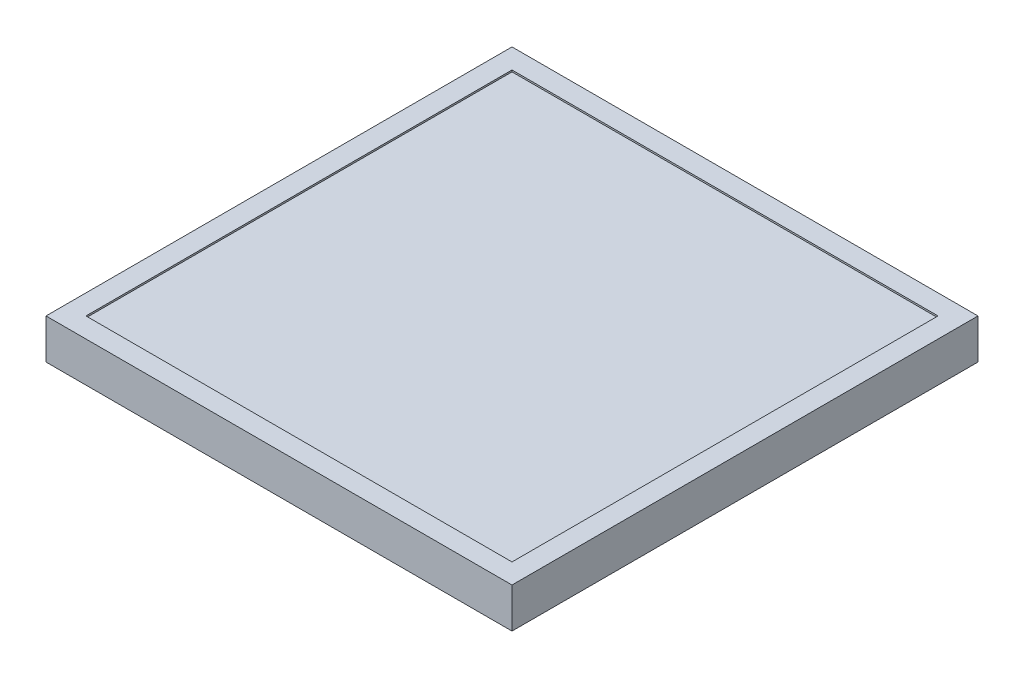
from build123d import *

# Parameters (mm, degrees)
CROQUIS1_W              = 280
CROQUIS1_H              = 280
SALIENTE_EXTRUIR1_DEPTH = 24
CROQUIS3_W              = 256
CROQUIS3_H              = 256
CORTAR_EXTRUIR2_DEPTH   = 1


with BuildPart() as part:
    # Croquis1 → Saliente-Extruir1 (new body)
    with BuildSketch(Plane(origin=(0, 0, 0), x_dir=(1, 0, 0), z_dir=(0, 1, 0))):
        with Locations((4.143471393, -5.254894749)):
            Rectangle(CROQUIS1_W, CROQUIS1_H)
    extrude(amount=SALIENTE_EXTRUIR1_DEPTH)

    # Croquis3 → Cortar-Extruir2 (cut)
    with BuildSketch(Plane(origin=(0, 24, 0), x_dir=(1, 0, 0), z_dir=(0, 1, 0))):
        with Locations((4.143471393, -5.254894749)):
            Rectangle(CROQUIS3_W, CROQUIS3_H)
    extrude(amount=-CORTAR_EXTRUIR2_DEPTH, mode=Mode.SUBTRACT)


solid = part.part
